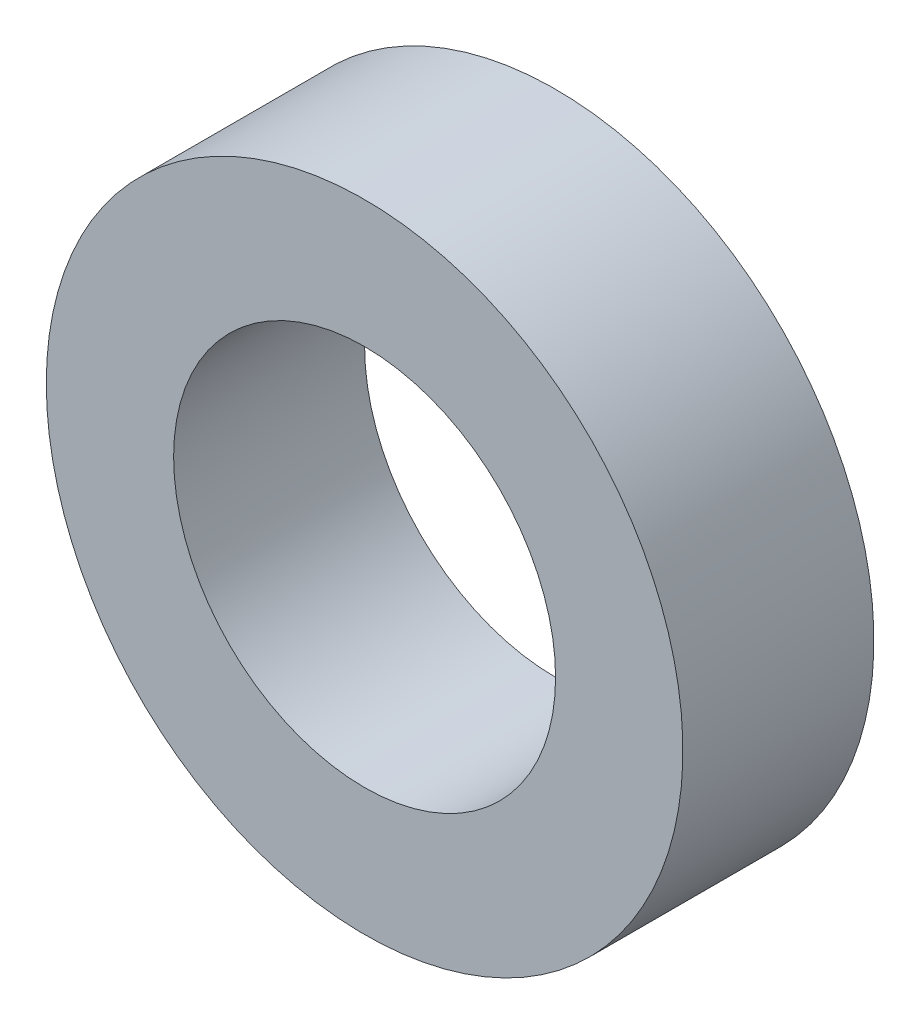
ISO-10303-21;
HEADER;
FILE_DESCRIPTION(('STEP AP214'),'2;1');
FILE_NAME('part.step','',(''),(''),'','','');
FILE_SCHEMA(('AUTOMOTIVE_DESIGN { 1 0 10303 214 1 1 1 1 }'));
ENDSEC;
DATA;
#1=APPLICATION_CONTEXT('core data for automotive mechanical design processes');
#2=APPLICATION_PROTOCOL_DEFINITION('international standard','automotive_design',2000,#1);
#3=PRODUCT_CONTEXT('',#1,'mechanical');
#4=PRODUCT('Part','Part','',(#3));
#5=PRODUCT_RELATED_PRODUCT_CATEGORY('part','',(#4));
#6=PRODUCT_DEFINITION_FORMATION('','',#4);
#7=PRODUCT_DEFINITION_CONTEXT('part definition',#1,'design');
#8=PRODUCT_DEFINITION('design','',#6,#7);
#9=PRODUCT_DEFINITION_SHAPE('','',#8);
#10=(LENGTH_UNIT() NAMED_UNIT(*) SI_UNIT(.MILLI.,.METRE.));
#11=(NAMED_UNIT(*) PLANE_ANGLE_UNIT() SI_UNIT($,.RADIAN.));
#12=(NAMED_UNIT(*) SI_UNIT($,.STERADIAN.) SOLID_ANGLE_UNIT());
#13=UNCERTAINTY_MEASURE_WITH_UNIT(LENGTH_MEASURE(1.E-05),#10,'distance_accuracy_value','');
#14=(GEOMETRIC_REPRESENTATION_CONTEXT(3) GLOBAL_UNCERTAINTY_ASSIGNED_CONTEXT((#13)) GLOBAL_UNIT_ASSIGNED_CONTEXT((#10,
#11,#12)) REPRESENTATION_CONTEXT('',''));
#15=CARTESIAN_POINT('',(0.,0.,0.));
#16=DIRECTION('',(0.,0.,1.));
#17=DIRECTION('',(1.,0.,0.));
#18=AXIS2_PLACEMENT_3D('',#15,#16,#17);
#19=CARTESIAN_POINT('',(0.,0.,0.));
#20=DIRECTION('',(0.,0.,1.));
#21=DIRECTION('',(1.,0.,0.));
#22=AXIS2_PLACEMENT_3D('',#19,#20,#21);
#23=PLANE('',#22);
#24=CARTESIAN_POINT('',(0.,0.,0.));
#25=DIRECTION('',(0.,0.,-1.));
#26=DIRECTION('',(-1.,0.,0.));
#27=AXIS2_PLACEMENT_3D('',#24,#25,#26);
#28=CIRCLE('',#27,6.);
#29=CARTESIAN_POINT('',(-6.,0.,0.));
#30=VERTEX_POINT('',#29);
#31=EDGE_CURVE('E25',#30,#30,#28,.F.);
#32=ORIENTED_EDGE('',*,*,#31,.T.);
#33=EDGE_LOOP('',(#32));
#34=FACE_BOUND('',#33,.T.);
#35=CARTESIAN_POINT('',(0.,0.,0.));
#36=DIRECTION('',(0.,0.,-1.));
#37=DIRECTION('',(-1.,0.,0.));
#38=AXIS2_PLACEMENT_3D('',#35,#36,#37);
#39=CIRCLE('',#38,10.);
#40=CARTESIAN_POINT('',(-10.,0.,0.));
#41=VERTEX_POINT('',#40);
#42=EDGE_CURVE('E16',#41,#41,#39,.F.);
#43=ORIENTED_EDGE('',*,*,#42,.F.);
#44=EDGE_LOOP('',(#43));
#45=FACE_BOUND('',#44,.T.);
#46=ADVANCED_FACE('F13',(#34,#45),#23,.F.);
#47=CARTESIAN_POINT('',(0.,0.,6.));
#48=DIRECTION('',(0.,0.,-1.));
#49=DIRECTION('',(-1.,0.,0.));
#50=AXIS2_PLACEMENT_3D('',#47,#48,#49);
#51=CYLINDRICAL_SURFACE('',#50,10.);
#52=ORIENTED_EDGE('',*,*,#42,.T.);
#53=EDGE_LOOP('',(#52));
#54=FACE_BOUND('',#53,.T.);
#55=CARTESIAN_POINT('',(0.,0.,6.));
#56=DIRECTION('',(0.,0.,-1.));
#57=DIRECTION('',(-1.,0.,0.));
#58=AXIS2_PLACEMENT_3D('',#55,#56,#57);
#59=CIRCLE('',#58,10.);
#60=CARTESIAN_POINT('',(-10.,0.,6.));
#61=VERTEX_POINT('',#60);
#62=EDGE_CURVE('E20',#61,#61,#59,.F.);
#63=ORIENTED_EDGE('',*,*,#62,.F.);
#64=EDGE_LOOP('',(#63));
#65=FACE_BOUND('',#64,.T.);
#66=ADVANCED_FACE('F33',(#54,#65),#51,.T.);
#67=CARTESIAN_POINT('',(0.,0.,6.));
#68=DIRECTION('',(0.,0.,-1.));
#69=DIRECTION('',(-1.,0.,0.));
#70=AXIS2_PLACEMENT_3D('',#67,#68,#69);
#71=CYLINDRICAL_SURFACE('',#70,6.);
#72=CARTESIAN_POINT('',(0.,0.,6.));
#73=DIRECTION('',(0.,0.,-1.));
#74=DIRECTION('',(-1.,0.,0.));
#75=AXIS2_PLACEMENT_3D('',#72,#73,#74);
#76=CIRCLE('',#75,6.);
#77=CARTESIAN_POINT('',(-6.,0.,6.));
#78=VERTEX_POINT('',#77);
#79=EDGE_CURVE('E9',#78,#78,#76,.T.);
#80=ORIENTED_EDGE('',*,*,#79,.F.);
#81=EDGE_LOOP('',(#80));
#82=FACE_BOUND('',#81,.T.);
#83=ORIENTED_EDGE('',*,*,#31,.F.);
#84=EDGE_LOOP('',(#83));
#85=FACE_BOUND('',#84,.T.);
#86=ADVANCED_FACE('F41',(#82,#85),#71,.F.);
#87=CARTESIAN_POINT('',(0.,0.,6.));
#88=DIRECTION('',(0.,0.,1.));
#89=DIRECTION('',(1.,0.,0.));
#90=AXIS2_PLACEMENT_3D('',#87,#88,#89);
#91=PLANE('',#90);
#92=ORIENTED_EDGE('',*,*,#79,.T.);
#93=EDGE_LOOP('',(#92));
#94=FACE_BOUND('',#93,.T.);
#95=ORIENTED_EDGE('',*,*,#62,.T.);
#96=EDGE_LOOP('',(#95));
#97=FACE_BOUND('',#96,.T.);
#98=ADVANCED_FACE('F42',(#94,#97),#91,.T.);
#99=CLOSED_SHELL('',(#46,#66,#86,#98));
#100=MANIFOLD_SOLID_BREP('B1',#99);
#101=ADVANCED_BREP_SHAPE_REPRESENTATION('',(#18,#100),#14);
#102=SHAPE_DEFINITION_REPRESENTATION(#9,#101);
ENDSEC;
END-ISO-10303-21;
